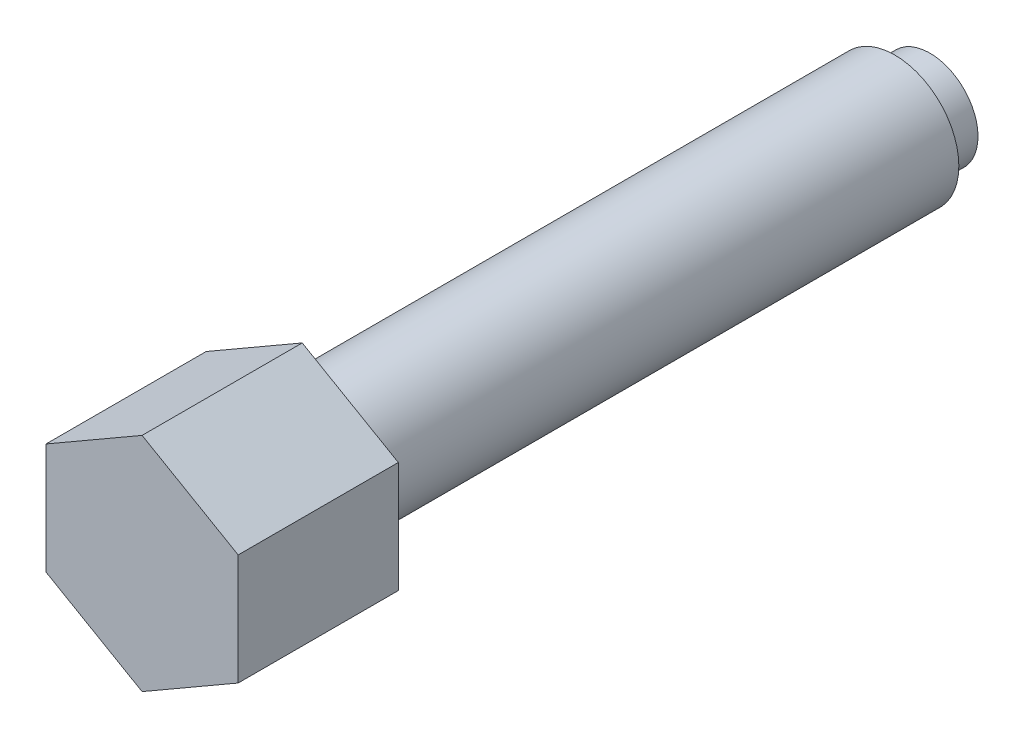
ISO-10303-21;
HEADER;
FILE_DESCRIPTION(('STEP AP214'),'2;1');
FILE_NAME('part.step','',(''),(''),'','','');
FILE_SCHEMA(('AUTOMOTIVE_DESIGN { 1 0 10303 214 1 1 1 1 }'));
ENDSEC;
DATA;
#1=APPLICATION_CONTEXT('core data for automotive mechanical design processes');
#2=APPLICATION_PROTOCOL_DEFINITION('international standard','automotive_design',2000,#1);
#3=PRODUCT_CONTEXT('',#1,'mechanical');
#4=PRODUCT('Part','Part','',(#3));
#5=PRODUCT_RELATED_PRODUCT_CATEGORY('part','',(#4));
#6=PRODUCT_DEFINITION_FORMATION('','',#4);
#7=PRODUCT_DEFINITION_CONTEXT('part definition',#1,'design');
#8=PRODUCT_DEFINITION('design','',#6,#7);
#9=PRODUCT_DEFINITION_SHAPE('','',#8);
#10=(LENGTH_UNIT() NAMED_UNIT(*) SI_UNIT(.MILLI.,.METRE.));
#11=(NAMED_UNIT(*) PLANE_ANGLE_UNIT() SI_UNIT($,.RADIAN.));
#12=(NAMED_UNIT(*) SI_UNIT($,.STERADIAN.) SOLID_ANGLE_UNIT());
#13=UNCERTAINTY_MEASURE_WITH_UNIT(LENGTH_MEASURE(1.E-05),#10,'distance_accuracy_value','');
#14=(GEOMETRIC_REPRESENTATION_CONTEXT(3) GLOBAL_UNCERTAINTY_ASSIGNED_CONTEXT((#13)) GLOBAL_UNIT_ASSIGNED_CONTEXT((#10,
#11,#12)) REPRESENTATION_CONTEXT('',''));
#15=CARTESIAN_POINT('',(0.,0.,0.));
#16=DIRECTION('',(0.,0.,1.));
#17=DIRECTION('',(1.,0.,0.));
#18=AXIS2_PLACEMENT_3D('',#15,#16,#17);
#19=CARTESIAN_POINT('',(0.,0.,12.));
#20=DIRECTION('',(0.,0.,1.));
#21=DIRECTION('',(1.,0.,0.));
#22=AXIS2_PLACEMENT_3D('',#19,#20,#21);
#23=SPHERICAL_SURFACE('',#22,12.);
#24=CARTESIAN_POINT('',(0.,0.,1.60769515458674));
#25=DIRECTION('',(0.,0.,1.));
#26=DIRECTION('',(1.,0.,0.));
#27=AXIS2_PLACEMENT_3D('',#24,#25,#26);
#28=CIRCLE('',#27,6.);
#29=CARTESIAN_POINT('',(6.,0.,1.60769515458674));
#30=VERTEX_POINT('',#29);
#31=EDGE_CURVE('E9',#30,#30,#28,.T.);
#32=ORIENTED_EDGE('',*,*,#31,.F.);
#33=EDGE_LOOP('',(#32));
#34=FACE_BOUND('',#33,.T.);
#35=ADVANCED_FACE('F14',(#34),#23,.T.);
#36=CARTESIAN_POINT('',(0.,0.,110.));
#37=DIRECTION('',(0.,0.,1.));
#38=DIRECTION('',(1.,0.,0.));
#39=AXIS2_PLACEMENT_3D('',#36,#37,#38);
#40=CYLINDRICAL_SURFACE('',#39,6.);
#41=ORIENTED_EDGE('',*,*,#31,.T.);
#42=EDGE_LOOP('',(#41));
#43=FACE_BOUND('',#42,.T.);
#44=CARTESIAN_POINT('',(0.,0.,6.));
#45=DIRECTION('',(0.,0.,1.));
#46=DIRECTION('',(1.,0.,0.));
#47=AXIS2_PLACEMENT_3D('',#44,#45,#46);
#48=CIRCLE('',#47,6.);
#49=CARTESIAN_POINT('',(6.,0.,6.));
#50=VERTEX_POINT('',#49);
#51=EDGE_CURVE('E21',#50,#50,#48,.T.);
#52=ORIENTED_EDGE('',*,*,#51,.F.);
#53=EDGE_LOOP('',(#52));
#54=FACE_BOUND('',#53,.T.);
#55=ADVANCED_FACE('F126',(#43,#54),#40,.T.);
#56=CARTESIAN_POINT('',(6.,0.,6.));
#57=DIRECTION('',(0.,0.,1.));
#58=DIRECTION('',(1.,0.,0.));
#59=AXIS2_PLACEMENT_3D('',#56,#57,#58);
#60=PLANE('',#59);
#61=CARTESIAN_POINT('',(0.,0.,6.));
#62=DIRECTION('',(0.,0.,1.));
#63=DIRECTION('',(1.,0.,0.));
#64=AXIS2_PLACEMENT_3D('',#61,#62,#63);
#65=CIRCLE('',#64,8.);
#66=CARTESIAN_POINT('',(8.,0.,6.));
#67=VERTEX_POINT('',#66);
#68=EDGE_CURVE('E119',#67,#67,#65,.T.);
#69=ORIENTED_EDGE('',*,*,#68,.F.);
#70=EDGE_LOOP('',(#69));
#71=FACE_BOUND('',#70,.T.);
#72=ORIENTED_EDGE('',*,*,#51,.T.);
#73=EDGE_LOOP('',(#72));
#74=FACE_BOUND('',#73,.T.);
#75=ADVANCED_FACE('F124',(#71,#74),#60,.F.);
#76=CARTESIAN_POINT('',(0.,0.,110.));
#77=DIRECTION('',(0.,0.,1.));
#78=DIRECTION('',(1.,0.,0.));
#79=AXIS2_PLACEMENT_3D('',#76,#77,#78);
#80=CYLINDRICAL_SURFACE('',#79,8.);
#81=CARTESIAN_POINT('',(0.,0.,80.));
#82=DIRECTION('',(0.,0.,1.));
#83=DIRECTION('',(1.,0.,0.));
#84=AXIS2_PLACEMENT_3D('',#81,#82,#83);
#85=CIRCLE('',#84,8.);
#86=CARTESIAN_POINT('',(8.,0.,80.));
#87=VERTEX_POINT('',#86);
#88=EDGE_CURVE('E74',#87,#87,#85,.T.);
#89=ORIENTED_EDGE('',*,*,#88,.F.);
#90=EDGE_LOOP('',(#89));
#91=FACE_BOUND('',#90,.T.);
#92=ORIENTED_EDGE('',*,*,#68,.T.);
#93=EDGE_LOOP('',(#92));
#94=FACE_BOUND('',#93,.T.);
#95=ADVANCED_FACE('F135',(#91,#94),#80,.T.);
#96=CARTESIAN_POINT('',(8.,0.,80.));
#97=DIRECTION('',(0.,0.,1.));
#98=DIRECTION('',(1.,0.,0.));
#99=AXIS2_PLACEMENT_3D('',#96,#97,#98);
#100=PLANE('',#99);
#101=DIRECTION('',(-0.866025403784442,-0.5,0.));
#102=VECTOR('',#101,1.);
#103=CARTESIAN_POINT('',(0.,13.856406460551,80.));
#104=LINE('',#103,#102);
#105=CARTESIAN_POINT('',(0.,13.856406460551,80.));
#106=VERTEX_POINT('',#105);
#107=CARTESIAN_POINT('',(-12.,6.92820323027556,80.));
#108=VERTEX_POINT('',#107);
#109=EDGE_CURVE('E94',#106,#108,#104,.T.);
#110=ORIENTED_EDGE('',*,*,#109,.F.);
#111=DIRECTION('',(0.86602540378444,-0.5,0.));
#112=VECTOR('',#111,1.);
#113=CARTESIAN_POINT('',(0.,13.856406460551,80.));
#114=LINE('',#113,#112);
#115=CARTESIAN_POINT('',(12.,6.92820323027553,80.));
#116=VERTEX_POINT('',#115);
#117=EDGE_CURVE('E28',#106,#116,#114,.T.);
#118=ORIENTED_EDGE('',*,*,#117,.T.);
#119=DIRECTION('',(0.,-1.,0.));
#120=VECTOR('',#119,1.);
#121=CARTESIAN_POINT('',(12.,6.92820323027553,80.));
#122=LINE('',#121,#120);
#123=CARTESIAN_POINT('',(12.,-6.9282032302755,80.));
#124=VERTEX_POINT('',#123);
#125=EDGE_CURVE('E73',#116,#124,#122,.T.);
#126=ORIENTED_EDGE('',*,*,#125,.T.);
#127=DIRECTION('',(0.866025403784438,0.5,0.));
#128=VECTOR('',#127,1.);
#129=CARTESIAN_POINT('',(0.,-13.856406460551,80.));
#130=LINE('',#129,#128);
#131=CARTESIAN_POINT('',(0.,-13.856406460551,80.));
#132=VERTEX_POINT('',#131);
#133=EDGE_CURVE('E103',#132,#124,#130,.T.);
#134=ORIENTED_EDGE('',*,*,#133,.F.);
#135=DIRECTION('',(-0.866025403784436,0.5,0.));
#136=VECTOR('',#135,1.);
#137=CARTESIAN_POINT('',(0.,-13.856406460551,80.));
#138=LINE('',#137,#136);
#139=CARTESIAN_POINT('',(-12.,-6.92820323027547,80.));
#140=VERTEX_POINT('',#139);
#141=EDGE_CURVE('E100',#132,#140,#138,.T.);
#142=ORIENTED_EDGE('',*,*,#141,.T.);
#143=DIRECTION('',(0.,-1.,0.));
#144=VECTOR('',#143,1.);
#145=CARTESIAN_POINT('',(-12.,6.92820323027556,80.));
#146=LINE('',#145,#144);
#147=EDGE_CURVE('E97',#108,#140,#146,.T.);
#148=ORIENTED_EDGE('',*,*,#147,.F.);
#149=EDGE_LOOP('',(#110,#118,#126,#134,#142,#148));
#150=FACE_BOUND('',#149,.T.);
#151=ORIENTED_EDGE('',*,*,#88,.T.);
#152=EDGE_LOOP('',(#151));
#153=FACE_BOUND('',#152,.T.);
#154=ADVANCED_FACE('F142',(#150,#153),#100,.F.);
#155=CARTESIAN_POINT('',(0.,13.856406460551,80.));
#156=DIRECTION('',(-0.5,-0.86602540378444,0.));
#157=DIRECTION('',(0.86602540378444,-0.5,0.));
#158=AXIS2_PLACEMENT_3D('',#155,#156,#157);
#159=PLANE('',#158);
#160=DIRECTION('',(0.,0.,1.));
#161=VECTOR('',#160,1.);
#162=CARTESIAN_POINT('',(12.,6.92820323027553,80.));
#163=LINE('',#162,#161);
#164=CARTESIAN_POINT('',(12.,6.92820323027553,100.));
#165=VERTEX_POINT('',#164);
#166=EDGE_CURVE('E66',#116,#165,#163,.T.);
#167=ORIENTED_EDGE('',*,*,#166,.F.);
#168=ORIENTED_EDGE('',*,*,#117,.F.);
#169=DIRECTION('',(0.,0.,1.));
#170=VECTOR('',#169,1.);
#171=CARTESIAN_POINT('',(0.,13.856406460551,80.));
#172=LINE('',#171,#170);
#173=CARTESIAN_POINT('',(0.,13.856406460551,100.));
#174=VERTEX_POINT('',#173);
#175=EDGE_CURVE('E80',#106,#174,#172,.T.);
#176=ORIENTED_EDGE('',*,*,#175,.T.);
#177=DIRECTION('',(0.86602540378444,-0.5,0.));
#178=VECTOR('',#177,1.);
#179=CARTESIAN_POINT('',(0.,13.856406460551,100.));
#180=LINE('',#179,#178);
#181=EDGE_CURVE('E78',#174,#165,#180,.T.);
#182=ORIENTED_EDGE('',*,*,#181,.T.);
#183=EDGE_LOOP('',(#167,#168,#176,#182));
#184=FACE_BOUND('',#183,.T.);
#185=ADVANCED_FACE('F79',(#184),#159,.F.);
#186=CARTESIAN_POINT('',(12.,6.92820323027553,80.));
#187=DIRECTION('',(-1.,0.,0.));
#188=DIRECTION('',(0.,0.,1.));
#189=AXIS2_PLACEMENT_3D('',#186,#187,#188);
#190=PLANE('',#189);
#191=DIRECTION('',(0.,0.,1.));
#192=VECTOR('',#191,1.);
#193=CARTESIAN_POINT('',(12.,-6.9282032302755,80.));
#194=LINE('',#193,#192);
#195=CARTESIAN_POINT('',(12.,-6.9282032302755,100.));
#196=VERTEX_POINT('',#195);
#197=EDGE_CURVE('E75',#124,#196,#194,.T.);
#198=ORIENTED_EDGE('',*,*,#197,.F.);
#199=ORIENTED_EDGE('',*,*,#125,.F.);
#200=ORIENTED_EDGE('',*,*,#166,.T.);
#201=DIRECTION('',(0.,-1.,0.));
#202=VECTOR('',#201,1.);
#203=CARTESIAN_POINT('',(12.,6.92820323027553,100.));
#204=LINE('',#203,#202);
#205=EDGE_CURVE('E70',#165,#196,#204,.T.);
#206=ORIENTED_EDGE('',*,*,#205,.T.);
#207=EDGE_LOOP('',(#198,#199,#200,#206));
#208=FACE_BOUND('',#207,.T.);
#209=ADVANCED_FACE('F68',(#208),#190,.F.);
#210=CARTESIAN_POINT('',(0.,-13.856406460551,80.));
#211=DIRECTION('',(0.5,-0.866025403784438,0.));
#212=DIRECTION('',(0.866025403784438,0.5,0.));
#213=AXIS2_PLACEMENT_3D('',#210,#211,#212);
#214=PLANE('',#213);
#215=DIRECTION('',(0.,0.,1.));
#216=VECTOR('',#215,1.);
#217=CARTESIAN_POINT('',(0.,-13.856406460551,80.));
#218=LINE('',#217,#216);
#219=CARTESIAN_POINT('',(0.,-13.856406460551,100.));
#220=VERTEX_POINT('',#219);
#221=EDGE_CURVE('E114',#132,#220,#218,.T.);
#222=ORIENTED_EDGE('',*,*,#221,.F.);
#223=ORIENTED_EDGE('',*,*,#133,.T.);
#224=ORIENTED_EDGE('',*,*,#197,.T.);
#225=DIRECTION('',(0.866025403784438,0.5,0.));
#226=VECTOR('',#225,1.);
#227=CARTESIAN_POINT('',(0.,-13.856406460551,100.));
#228=LINE('',#227,#226);
#229=EDGE_CURVE('E88',#220,#196,#228,.T.);
#230=ORIENTED_EDGE('',*,*,#229,.F.);
#231=EDGE_LOOP('',(#222,#223,#224,#230));
#232=FACE_BOUND('',#231,.T.);
#233=ADVANCED_FACE('F152',(#232),#214,.T.);
#234=CARTESIAN_POINT('',(0.,-13.856406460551,80.));
#235=DIRECTION('',(0.5,0.866025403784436,0.));
#236=DIRECTION('',(-0.866025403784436,0.5,0.));
#237=AXIS2_PLACEMENT_3D('',#234,#235,#236);
#238=PLANE('',#237);
#239=DIRECTION('',(0.,0.,1.));
#240=VECTOR('',#239,1.);
#241=CARTESIAN_POINT('',(-12.,-6.92820323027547,80.));
#242=LINE('',#241,#240);
#243=CARTESIAN_POINT('',(-12.,-6.92820323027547,100.));
#244=VERTEX_POINT('',#243);
#245=EDGE_CURVE('E112',#140,#244,#242,.T.);
#246=ORIENTED_EDGE('',*,*,#245,.F.);
#247=ORIENTED_EDGE('',*,*,#141,.F.);
#248=ORIENTED_EDGE('',*,*,#221,.T.);
#249=DIRECTION('',(-0.866025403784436,0.5,0.));
#250=VECTOR('',#249,1.);
#251=CARTESIAN_POINT('',(0.,-13.856406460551,100.));
#252=LINE('',#251,#250);
#253=EDGE_CURVE('E90',#220,#244,#252,.T.);
#254=ORIENTED_EDGE('',*,*,#253,.T.);
#255=EDGE_LOOP('',(#246,#247,#248,#254));
#256=FACE_BOUND('',#255,.T.);
#257=ADVANCED_FACE('F155',(#256),#238,.F.);
#258=CARTESIAN_POINT('',(-12.,6.92820323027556,80.));
#259=DIRECTION('',(-1.,0.,0.));
#260=DIRECTION('',(0.,0.,1.));
#261=AXIS2_PLACEMENT_3D('',#258,#259,#260);
#262=PLANE('',#261);
#263=DIRECTION('',(0.,0.,1.));
#264=VECTOR('',#263,1.);
#265=CARTESIAN_POINT('',(-12.,6.92820323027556,80.));
#266=LINE('',#265,#264);
#267=CARTESIAN_POINT('',(-12.,6.92820323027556,100.));
#268=VERTEX_POINT('',#267);
#269=EDGE_CURVE('E110',#108,#268,#266,.T.);
#270=ORIENTED_EDGE('',*,*,#269,.F.);
#271=ORIENTED_EDGE('',*,*,#147,.T.);
#272=ORIENTED_EDGE('',*,*,#245,.T.);
#273=DIRECTION('',(0.,-1.,0.));
#274=VECTOR('',#273,1.);
#275=CARTESIAN_POINT('',(-12.,6.92820323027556,100.));
#276=LINE('',#275,#274);
#277=EDGE_CURVE('E36',#268,#244,#276,.T.);
#278=ORIENTED_EDGE('',*,*,#277,.F.);
#279=EDGE_LOOP('',(#270,#271,#272,#278));
#280=FACE_BOUND('',#279,.T.);
#281=ADVANCED_FACE('F159',(#280),#262,.T.);
#282=CARTESIAN_POINT('',(0.,13.856406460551,80.));
#283=DIRECTION('',(-0.5,0.866025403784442,0.));
#284=DIRECTION('',(-0.866025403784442,-0.5,0.));
#285=AXIS2_PLACEMENT_3D('',#282,#283,#284);
#286=PLANE('',#285);
#287=ORIENTED_EDGE('',*,*,#109,.T.);
#288=ORIENTED_EDGE('',*,*,#269,.T.);
#289=DIRECTION('',(-0.866025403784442,-0.5,0.));
#290=VECTOR('',#289,1.);
#291=CARTESIAN_POINT('',(0.,13.856406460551,100.));
#292=LINE('',#291,#290);
#293=EDGE_CURVE('E108',#174,#268,#292,.T.);
#294=ORIENTED_EDGE('',*,*,#293,.F.);
#295=ORIENTED_EDGE('',*,*,#175,.F.);
#296=EDGE_LOOP('',(#287,#288,#294,#295));
#297=FACE_BOUND('',#296,.T.);
#298=ADVANCED_FACE('F149',(#297),#286,.T.);
#299=CARTESIAN_POINT('',(0.,0.,100.));
#300=DIRECTION('',(0.,0.,1.));
#301=DIRECTION('',(1.,0.,0.));
#302=AXIS2_PLACEMENT_3D('',#299,#300,#301);
#303=PLANE('',#302);
#304=ORIENTED_EDGE('',*,*,#181,.F.);
#305=ORIENTED_EDGE('',*,*,#293,.T.);
#306=ORIENTED_EDGE('',*,*,#277,.T.);
#307=ORIENTED_EDGE('',*,*,#253,.F.);
#308=ORIENTED_EDGE('',*,*,#229,.T.);
#309=ORIENTED_EDGE('',*,*,#205,.F.);
#310=EDGE_LOOP('',(#304,#305,#306,#307,#308,#309));
#311=FACE_BOUND('',#310,.T.);
#312=ADVANCED_FACE('F85',(#311),#303,.T.);
#313=CLOSED_SHELL('',(#35,#55,#75,#95,#154,#185,#209,#233,#257,#281,#298,#312));
#314=MANIFOLD_SOLID_BREP('B1',#313);
#315=ADVANCED_BREP_SHAPE_REPRESENTATION('',(#18,#314),#14);
#316=SHAPE_DEFINITION_REPRESENTATION(#9,#315);
ENDSEC;
END-ISO-10303-21;
